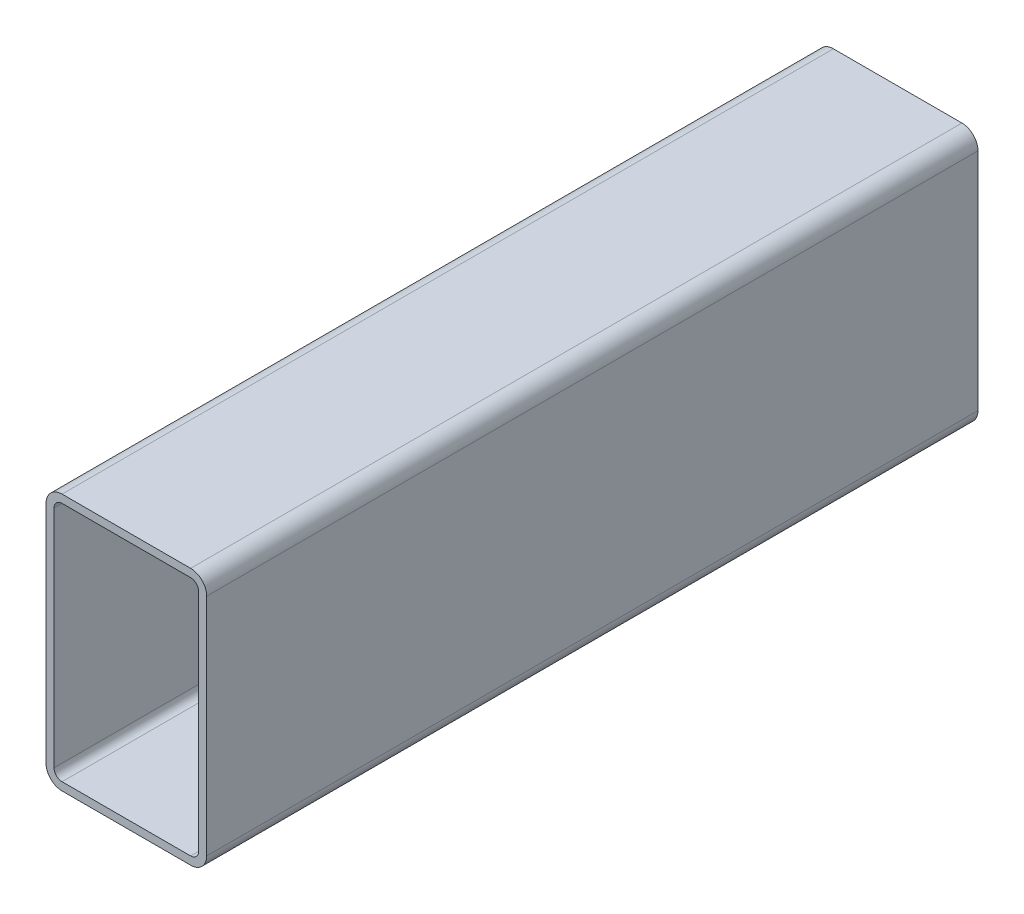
ISO-10303-21;
HEADER;
FILE_DESCRIPTION(('STEP AP214'),'2;1');
FILE_NAME('part.step','',(''),(''),'','','');
FILE_SCHEMA(('AUTOMOTIVE_DESIGN { 1 0 10303 214 1 1 1 1 }'));
ENDSEC;
DATA;
#1=APPLICATION_CONTEXT('core data for automotive mechanical design processes');
#2=APPLICATION_PROTOCOL_DEFINITION('international standard','automotive_design',2000,#1);
#3=PRODUCT_CONTEXT('',#1,'mechanical');
#4=PRODUCT('Part','Part','',(#3));
#5=PRODUCT_RELATED_PRODUCT_CATEGORY('part','',(#4));
#6=PRODUCT_DEFINITION_FORMATION('','',#4);
#7=PRODUCT_DEFINITION_CONTEXT('part definition',#1,'design');
#8=PRODUCT_DEFINITION('design','',#6,#7);
#9=PRODUCT_DEFINITION_SHAPE('','',#8);
#10=(LENGTH_UNIT() NAMED_UNIT(*) SI_UNIT(.MILLI.,.METRE.));
#11=(NAMED_UNIT(*) PLANE_ANGLE_UNIT() SI_UNIT($,.RADIAN.));
#12=(NAMED_UNIT(*) SI_UNIT($,.STERADIAN.) SOLID_ANGLE_UNIT());
#13=UNCERTAINTY_MEASURE_WITH_UNIT(LENGTH_MEASURE(1.E-05),#10,'distance_accuracy_value','');
#14=(GEOMETRIC_REPRESENTATION_CONTEXT(3) GLOBAL_UNCERTAINTY_ASSIGNED_CONTEXT((#13)) GLOBAL_UNIT_ASSIGNED_CONTEXT((#10,
#11,#12)) REPRESENTATION_CONTEXT('',''));
#15=CARTESIAN_POINT('',(0.,0.,0.));
#16=DIRECTION('',(0.,0.,1.));
#17=DIRECTION('',(1.,0.,0.));
#18=AXIS2_PLACEMENT_3D('',#15,#16,#17);
#19=CARTESIAN_POINT('',(9.24608514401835,97.3077651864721,304.8));
#20=DIRECTION('',(0.,0.,1.));
#21=DIRECTION('',(1.,0.,0.));
#22=AXIS2_PLACEMENT_3D('',#19,#20,#21);
#23=PLANE('',#22);
#24=CARTESIAN_POINT('',(9.24608514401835,97.3077651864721,304.8));
#25=DIRECTION('',(0.,0.,1.));
#26=DIRECTION('',(1.,0.,0.));
#27=AXIS2_PLACEMENT_3D('',#24,#25,#26);
#28=CIRCLE('',#27,6.35000000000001);
#29=CARTESIAN_POINT('',(9.24608514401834,103.657765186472,304.8));
#30=VERTEX_POINT('',#29);
#31=CARTESIAN_POINT('',(2.89608514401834,97.3077651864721,304.8));
#32=VERTEX_POINT('',#31);
#33=EDGE_CURVE('E211',#30,#32,#28,.T.);
#34=ORIENTED_EDGE('',*,*,#33,.T.);
#35=DIRECTION('',(0.,-1.,0.));
#36=VECTOR('',#35,1.);
#37=CARTESIAN_POINT('',(2.89608514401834,8.40776518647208,304.8));
#38=LINE('',#37,#36);
#39=CARTESIAN_POINT('',(2.89608514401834,8.40776518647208,304.8));
#40=VERTEX_POINT('',#39);
#41=EDGE_CURVE('E214',#32,#40,#38,.T.);
#42=ORIENTED_EDGE('',*,*,#41,.T.);
#43=CARTESIAN_POINT('',(9.24608514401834,8.40776518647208,304.8));
#44=DIRECTION('',(0.,0.,1.));
#45=DIRECTION('',(1.,0.,0.));
#46=AXIS2_PLACEMENT_3D('',#43,#44,#45);
#47=CIRCLE('',#46,6.35);
#48=CARTESIAN_POINT('',(9.24608514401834,2.05776518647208,304.8));
#49=VERTEX_POINT('',#48);
#50=EDGE_CURVE('E217',#40,#49,#47,.T.);
#51=ORIENTED_EDGE('',*,*,#50,.T.);
#52=DIRECTION('',(1.,0.,0.));
#53=VECTOR('',#52,1.);
#54=CARTESIAN_POINT('',(60.0460851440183,2.05776518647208,304.8));
#55=LINE('',#54,#53);
#56=CARTESIAN_POINT('',(60.0460851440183,2.05776518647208,304.8));
#57=VERTEX_POINT('',#56);
#58=EDGE_CURVE('E219',#49,#57,#55,.T.);
#59=ORIENTED_EDGE('',*,*,#58,.T.);
#60=CARTESIAN_POINT('',(60.0460851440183,8.40776518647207,304.8));
#61=DIRECTION('',(0.,0.,1.));
#62=DIRECTION('',(1.,0.,0.));
#63=AXIS2_PLACEMENT_3D('',#60,#61,#62);
#64=CIRCLE('',#63,6.35);
#65=CARTESIAN_POINT('',(66.3960851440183,8.40776518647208,304.8));
#66=VERTEX_POINT('',#65);
#67=EDGE_CURVE('E221',#57,#66,#64,.T.);
#68=ORIENTED_EDGE('',*,*,#67,.T.);
#69=DIRECTION('',(0.,1.,0.));
#70=VECTOR('',#69,1.);
#71=CARTESIAN_POINT('',(66.3960851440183,97.3077651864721,304.8));
#72=LINE('',#71,#70);
#73=CARTESIAN_POINT('',(66.3960851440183,97.3077651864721,304.8));
#74=VERTEX_POINT('',#73);
#75=EDGE_CURVE('E223',#66,#74,#72,.T.);
#76=ORIENTED_EDGE('',*,*,#75,.T.);
#77=CARTESIAN_POINT('',(60.0460851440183,97.3077651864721,304.8));
#78=DIRECTION('',(0.,0.,1.));
#79=DIRECTION('',(1.,0.,0.));
#80=AXIS2_PLACEMENT_3D('',#77,#78,#79);
#81=CIRCLE('',#80,6.35);
#82=CARTESIAN_POINT('',(60.0460851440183,103.657765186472,304.8));
#83=VERTEX_POINT('',#82);
#84=EDGE_CURVE('E225',#74,#83,#81,.T.);
#85=ORIENTED_EDGE('',*,*,#84,.T.);
#86=DIRECTION('',(-1.,0.,0.));
#87=VECTOR('',#86,1.);
#88=CARTESIAN_POINT('',(9.24608514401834,103.657765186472,304.8));
#89=LINE('',#88,#87);
#90=EDGE_CURVE('E227',#83,#30,#89,.T.);
#91=ORIENTED_EDGE('',*,*,#90,.T.);
#92=EDGE_LOOP('',(#34,#42,#51,#59,#68,#76,#85,#91));
#93=FACE_BOUND('',#92,.T.);
#94=DIRECTION('',(0.,-1.,0.));
#95=VECTOR('',#94,1.);
#96=CARTESIAN_POINT('',(6.07108514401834,8.40776518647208,304.8));
#97=LINE('',#96,#95);
#98=CARTESIAN_POINT('',(6.07108514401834,97.3077651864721,304.8));
#99=VERTEX_POINT('',#98);
#100=CARTESIAN_POINT('',(6.07108514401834,8.40776518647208,304.8));
#101=VERTEX_POINT('',#100);
#102=EDGE_CURVE('E154',#99,#101,#97,.T.);
#103=ORIENTED_EDGE('',*,*,#102,.F.);
#104=CARTESIAN_POINT('',(9.24608514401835,97.3077651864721,304.8));
#105=DIRECTION('',(0.,0.,1.));
#106=DIRECTION('',(1.,0.,0.));
#107=AXIS2_PLACEMENT_3D('',#104,#105,#106);
#108=CIRCLE('',#107,3.17500000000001);
#109=CARTESIAN_POINT('',(9.24608514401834,100.482765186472,304.8));
#110=VERTEX_POINT('',#109);
#111=EDGE_CURVE('E146',#110,#99,#108,.T.);
#112=ORIENTED_EDGE('',*,*,#111,.F.);
#113=DIRECTION('',(-1.,0.,0.));
#114=VECTOR('',#113,1.);
#115=CARTESIAN_POINT('',(9.24608514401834,100.482765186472,304.8));
#116=LINE('',#115,#114);
#117=CARTESIAN_POINT('',(60.0460851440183,100.482765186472,304.8));
#118=VERTEX_POINT('',#117);
#119=EDGE_CURVE('E179',#118,#110,#116,.T.);
#120=ORIENTED_EDGE('',*,*,#119,.F.);
#121=CARTESIAN_POINT('',(60.0460851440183,97.3077651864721,304.8));
#122=DIRECTION('',(0.,0.,1.));
#123=DIRECTION('',(1.,0.,0.));
#124=AXIS2_PLACEMENT_3D('',#121,#122,#123);
#125=CIRCLE('',#124,3.17500000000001);
#126=CARTESIAN_POINT('',(63.2210851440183,97.3077651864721,304.8));
#127=VERTEX_POINT('',#126);
#128=EDGE_CURVE('E177',#127,#118,#125,.T.);
#129=ORIENTED_EDGE('',*,*,#128,.F.);
#130=DIRECTION('',(0.,1.,0.));
#131=VECTOR('',#130,1.);
#132=CARTESIAN_POINT('',(63.2210851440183,97.3077651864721,304.8));
#133=LINE('',#132,#131);
#134=CARTESIAN_POINT('',(63.2210851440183,8.40776518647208,304.8));
#135=VERTEX_POINT('',#134);
#136=EDGE_CURVE('E175',#135,#127,#133,.T.);
#137=ORIENTED_EDGE('',*,*,#136,.F.);
#138=CARTESIAN_POINT('',(60.0460851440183,8.40776518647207,304.8));
#139=DIRECTION('',(0.,0.,1.));
#140=DIRECTION('',(1.,0.,0.));
#141=AXIS2_PLACEMENT_3D('',#138,#139,#140);
#142=CIRCLE('',#141,3.175);
#143=CARTESIAN_POINT('',(60.0460851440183,5.23276518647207,304.8));
#144=VERTEX_POINT('',#143);
#145=EDGE_CURVE('E173',#144,#135,#142,.T.);
#146=ORIENTED_EDGE('',*,*,#145,.F.);
#147=DIRECTION('',(1.,0.,0.));
#148=VECTOR('',#147,1.);
#149=CARTESIAN_POINT('',(60.0460851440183,5.23276518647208,304.8));
#150=LINE('',#149,#148);
#151=CARTESIAN_POINT('',(9.24608514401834,5.23276518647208,304.8));
#152=VERTEX_POINT('',#151);
#153=EDGE_CURVE('E169',#152,#144,#150,.T.);
#154=ORIENTED_EDGE('',*,*,#153,.F.);
#155=CARTESIAN_POINT('',(9.24608514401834,8.40776518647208,304.8));
#156=DIRECTION('',(0.,0.,1.));
#157=DIRECTION('',(1.,0.,0.));
#158=AXIS2_PLACEMENT_3D('',#155,#156,#157);
#159=CIRCLE('',#158,3.175);
#160=EDGE_CURVE('E167',#101,#152,#159,.T.);
#161=ORIENTED_EDGE('',*,*,#160,.F.);
#162=EDGE_LOOP('',(#103,#112,#120,#129,#137,#146,#154,#161));
#163=FACE_BOUND('',#162,.T.);
#164=ADVANCED_FACE('F33',(#93,#163),#23,.T.);
#165=CARTESIAN_POINT('',(9.24608514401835,97.3077651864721,0.));
#166=DIRECTION('',(0.,0.,1.));
#167=DIRECTION('',(1.,0.,0.));
#168=AXIS2_PLACEMENT_3D('',#165,#166,#167);
#169=PLANE('',#168);
#170=CARTESIAN_POINT('',(9.24608514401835,97.3077651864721,0.));
#171=DIRECTION('',(0.,0.,1.));
#172=DIRECTION('',(1.,0.,0.));
#173=AXIS2_PLACEMENT_3D('',#170,#171,#172);
#174=CIRCLE('',#173,6.35000000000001);
#175=CARTESIAN_POINT('',(9.24608514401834,103.657765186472,0.));
#176=VERTEX_POINT('',#175);
#177=CARTESIAN_POINT('',(2.89608514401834,97.3077651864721,0.));
#178=VERTEX_POINT('',#177);
#179=EDGE_CURVE('E162',#176,#178,#174,.T.);
#180=ORIENTED_EDGE('',*,*,#179,.F.);
#181=DIRECTION('',(-1.,0.,0.));
#182=VECTOR('',#181,1.);
#183=CARTESIAN_POINT('',(9.24608514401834,103.657765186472,0.));
#184=LINE('',#183,#182);
#185=CARTESIAN_POINT('',(60.0460851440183,103.657765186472,0.));
#186=VERTEX_POINT('',#185);
#187=EDGE_CURVE('E215',#186,#176,#184,.T.);
#188=ORIENTED_EDGE('',*,*,#187,.F.);
#189=CARTESIAN_POINT('',(60.0460851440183,97.3077651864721,0.));
#190=DIRECTION('',(0.,0.,1.));
#191=DIRECTION('',(1.,0.,0.));
#192=AXIS2_PLACEMENT_3D('',#189,#190,#191);
#193=CIRCLE('',#192,6.35);
#194=CARTESIAN_POINT('',(66.3960851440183,97.3077651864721,0.));
#195=VERTEX_POINT('',#194);
#196=EDGE_CURVE('E242',#195,#186,#193,.T.);
#197=ORIENTED_EDGE('',*,*,#196,.F.);
#198=DIRECTION('',(0.,1.,0.));
#199=VECTOR('',#198,1.);
#200=CARTESIAN_POINT('',(66.3960851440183,97.3077651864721,0.));
#201=LINE('',#200,#199);
#202=CARTESIAN_POINT('',(66.3960851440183,8.40776518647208,0.));
#203=VERTEX_POINT('',#202);
#204=EDGE_CURVE('E240',#203,#195,#201,.T.);
#205=ORIENTED_EDGE('',*,*,#204,.F.);
#206=CARTESIAN_POINT('',(60.0460851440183,8.40776518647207,0.));
#207=DIRECTION('',(0.,0.,1.));
#208=DIRECTION('',(1.,0.,0.));
#209=AXIS2_PLACEMENT_3D('',#206,#207,#208);
#210=CIRCLE('',#209,6.35);
#211=CARTESIAN_POINT('',(60.0460851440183,2.05776518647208,0.));
#212=VERTEX_POINT('',#211);
#213=EDGE_CURVE('E238',#212,#203,#210,.T.);
#214=ORIENTED_EDGE('',*,*,#213,.F.);
#215=DIRECTION('',(1.,0.,0.));
#216=VECTOR('',#215,1.);
#217=CARTESIAN_POINT('',(60.0460851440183,2.05776518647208,0.));
#218=LINE('',#217,#216);
#219=CARTESIAN_POINT('',(9.24608514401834,2.05776518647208,0.));
#220=VERTEX_POINT('',#219);
#221=EDGE_CURVE('E236',#220,#212,#218,.T.);
#222=ORIENTED_EDGE('',*,*,#221,.F.);
#223=CARTESIAN_POINT('',(9.24608514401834,8.40776518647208,0.));
#224=DIRECTION('',(0.,0.,1.));
#225=DIRECTION('',(1.,0.,0.));
#226=AXIS2_PLACEMENT_3D('',#223,#224,#225);
#227=CIRCLE('',#226,6.35);
#228=CARTESIAN_POINT('',(2.89608514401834,8.40776518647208,0.));
#229=VERTEX_POINT('',#228);
#230=EDGE_CURVE('E234',#229,#220,#227,.T.);
#231=ORIENTED_EDGE('',*,*,#230,.F.);
#232=DIRECTION('',(0.,-1.,0.));
#233=VECTOR('',#232,1.);
#234=CARTESIAN_POINT('',(2.89608514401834,8.40776518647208,0.));
#235=LINE('',#234,#233);
#236=EDGE_CURVE('E232',#178,#229,#235,.T.);
#237=ORIENTED_EDGE('',*,*,#236,.F.);
#238=EDGE_LOOP('',(#180,#188,#197,#205,#214,#222,#231,#237));
#239=FACE_BOUND('',#238,.T.);
#240=CARTESIAN_POINT('',(9.24608514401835,97.3077651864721,0.));
#241=DIRECTION('',(0.,0.,1.));
#242=DIRECTION('',(1.,0.,0.));
#243=AXIS2_PLACEMENT_3D('',#240,#241,#242);
#244=CIRCLE('',#243,3.17500000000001);
#245=CARTESIAN_POINT('',(9.24608514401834,100.482765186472,0.));
#246=VERTEX_POINT('',#245);
#247=CARTESIAN_POINT('',(6.07108514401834,97.3077651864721,0.));
#248=VERTEX_POINT('',#247);
#249=EDGE_CURVE('E56',#246,#248,#244,.T.);
#250=ORIENTED_EDGE('',*,*,#249,.T.);
#251=DIRECTION('',(0.,-1.,0.));
#252=VECTOR('',#251,1.);
#253=CARTESIAN_POINT('',(6.07108514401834,8.40776518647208,0.));
#254=LINE('',#253,#252);
#255=CARTESIAN_POINT('',(6.07108514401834,8.40776518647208,0.));
#256=VERTEX_POINT('',#255);
#257=EDGE_CURVE('E161',#248,#256,#254,.T.);
#258=ORIENTED_EDGE('',*,*,#257,.T.);
#259=CARTESIAN_POINT('',(9.24608514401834,8.40776518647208,0.));
#260=DIRECTION('',(0.,0.,1.));
#261=DIRECTION('',(1.,0.,0.));
#262=AXIS2_PLACEMENT_3D('',#259,#260,#261);
#263=CIRCLE('',#262,3.175);
#264=CARTESIAN_POINT('',(9.24608514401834,5.23276518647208,0.));
#265=VERTEX_POINT('',#264);
#266=EDGE_CURVE('E183',#256,#265,#263,.T.);
#267=ORIENTED_EDGE('',*,*,#266,.T.);
#268=DIRECTION('',(1.,0.,0.));
#269=VECTOR('',#268,1.);
#270=CARTESIAN_POINT('',(60.0460851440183,5.23276518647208,0.));
#271=LINE('',#270,#269);
#272=CARTESIAN_POINT('',(60.0460851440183,5.23276518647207,0.));
#273=VERTEX_POINT('',#272);
#274=EDGE_CURVE('E186',#265,#273,#271,.T.);
#275=ORIENTED_EDGE('',*,*,#274,.T.);
#276=CARTESIAN_POINT('',(60.0460851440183,8.40776518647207,0.));
#277=DIRECTION('',(0.,0.,1.));
#278=DIRECTION('',(1.,0.,0.));
#279=AXIS2_PLACEMENT_3D('',#276,#277,#278);
#280=CIRCLE('',#279,3.175);
#281=CARTESIAN_POINT('',(63.2210851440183,8.40776518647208,0.));
#282=VERTEX_POINT('',#281);
#283=EDGE_CURVE('E189',#273,#282,#280,.T.);
#284=ORIENTED_EDGE('',*,*,#283,.T.);
#285=DIRECTION('',(0.,1.,0.));
#286=VECTOR('',#285,1.);
#287=CARTESIAN_POINT('',(63.2210851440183,97.3077651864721,0.));
#288=LINE('',#287,#286);
#289=CARTESIAN_POINT('',(63.2210851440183,97.3077651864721,0.));
#290=VERTEX_POINT('',#289);
#291=EDGE_CURVE('E192',#282,#290,#288,.T.);
#292=ORIENTED_EDGE('',*,*,#291,.T.);
#293=CARTESIAN_POINT('',(60.0460851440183,97.3077651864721,0.));
#294=DIRECTION('',(0.,0.,1.));
#295=DIRECTION('',(1.,0.,0.));
#296=AXIS2_PLACEMENT_3D('',#293,#294,#295);
#297=CIRCLE('',#296,3.17500000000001);
#298=CARTESIAN_POINT('',(60.0460851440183,100.482765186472,0.));
#299=VERTEX_POINT('',#298);
#300=EDGE_CURVE('E195',#290,#299,#297,.T.);
#301=ORIENTED_EDGE('',*,*,#300,.T.);
#302=DIRECTION('',(-1.,0.,0.));
#303=VECTOR('',#302,1.);
#304=CARTESIAN_POINT('',(9.24608514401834,100.482765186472,0.));
#305=LINE('',#304,#303);
#306=EDGE_CURVE('E155',#299,#246,#305,.T.);
#307=ORIENTED_EDGE('',*,*,#306,.T.);
#308=EDGE_LOOP('',(#250,#258,#267,#275,#284,#292,#301,#307));
#309=FACE_BOUND('',#308,.T.);
#310=ADVANCED_FACE('F272',(#239,#309),#169,.F.);
#311=CARTESIAN_POINT('',(9.24608514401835,97.3077651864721,304.8));
#312=DIRECTION('',(0.,0.,-1.));
#313=DIRECTION('',(-1.,0.,0.));
#314=AXIS2_PLACEMENT_3D('',#311,#312,#313);
#315=CYLINDRICAL_SURFACE('',#314,6.35000000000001);
#316=ORIENTED_EDGE('',*,*,#179,.T.);
#317=DIRECTION('',(0.,0.,-1.));
#318=VECTOR('',#317,1.);
#319=CARTESIAN_POINT('',(2.89608514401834,97.3077651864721,304.8));
#320=LINE('',#319,#318);
#321=EDGE_CURVE('E11',#32,#178,#320,.T.);
#322=ORIENTED_EDGE('',*,*,#321,.F.);
#323=ORIENTED_EDGE('',*,*,#33,.F.);
#324=DIRECTION('',(0.,0.,-1.));
#325=VECTOR('',#324,1.);
#326=CARTESIAN_POINT('',(9.24608514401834,103.657765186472,304.8));
#327=LINE('',#326,#325);
#328=EDGE_CURVE('E229',#30,#176,#327,.T.);
#329=ORIENTED_EDGE('',*,*,#328,.T.);
#330=EDGE_LOOP('',(#316,#322,#323,#329));
#331=FACE_BOUND('',#330,.T.);
#332=ADVANCED_FACE('F35',(#331),#315,.T.);
#333=CARTESIAN_POINT('',(2.89608514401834,8.40776518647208,304.8));
#334=DIRECTION('',(1.,0.,0.));
#335=DIRECTION('',(0.,0.,-1.));
#336=AXIS2_PLACEMENT_3D('',#333,#334,#335);
#337=PLANE('',#336);
#338=ORIENTED_EDGE('',*,*,#236,.T.);
#339=DIRECTION('',(0.,0.,-1.));
#340=VECTOR('',#339,1.);
#341=CARTESIAN_POINT('',(2.89608514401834,8.40776518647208,304.8));
#342=LINE('',#341,#340);
#343=EDGE_CURVE('E41',#40,#229,#342,.T.);
#344=ORIENTED_EDGE('',*,*,#343,.F.);
#345=ORIENTED_EDGE('',*,*,#41,.F.);
#346=ORIENTED_EDGE('',*,*,#321,.T.);
#347=EDGE_LOOP('',(#338,#344,#345,#346));
#348=FACE_BOUND('',#347,.T.);
#349=ADVANCED_FACE('F289',(#348),#337,.F.);
#350=CARTESIAN_POINT('',(9.24608514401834,8.40776518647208,304.8));
#351=DIRECTION('',(0.,0.,-1.));
#352=DIRECTION('',(-1.,0.,0.));
#353=AXIS2_PLACEMENT_3D('',#350,#351,#352);
#354=CYLINDRICAL_SURFACE('',#353,6.35);
#355=ORIENTED_EDGE('',*,*,#230,.T.);
#356=DIRECTION('',(0.,0.,-1.));
#357=VECTOR('',#356,1.);
#358=CARTESIAN_POINT('',(9.24608514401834,2.05776518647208,304.8));
#359=LINE('',#358,#357);
#360=EDGE_CURVE('E259',#49,#220,#359,.T.);
#361=ORIENTED_EDGE('',*,*,#360,.F.);
#362=ORIENTED_EDGE('',*,*,#50,.F.);
#363=ORIENTED_EDGE('',*,*,#343,.T.);
#364=EDGE_LOOP('',(#355,#361,#362,#363));
#365=FACE_BOUND('',#364,.T.);
#366=ADVANCED_FACE('F266',(#365),#354,.T.);
#367=CARTESIAN_POINT('',(60.0460851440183,2.05776518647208,304.8));
#368=DIRECTION('',(0.,1.,0.));
#369=DIRECTION('',(0.,0.,1.));
#370=AXIS2_PLACEMENT_3D('',#367,#368,#369);
#371=PLANE('',#370);
#372=ORIENTED_EDGE('',*,*,#221,.T.);
#373=DIRECTION('',(0.,0.,-1.));
#374=VECTOR('',#373,1.);
#375=CARTESIAN_POINT('',(60.0460851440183,2.05776518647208,304.8));
#376=LINE('',#375,#374);
#377=EDGE_CURVE('E256',#57,#212,#376,.T.);
#378=ORIENTED_EDGE('',*,*,#377,.F.);
#379=ORIENTED_EDGE('',*,*,#58,.F.);
#380=ORIENTED_EDGE('',*,*,#360,.T.);
#381=EDGE_LOOP('',(#372,#378,#379,#380));
#382=FACE_BOUND('',#381,.T.);
#383=ADVANCED_FACE('F278',(#382),#371,.F.);
#384=CARTESIAN_POINT('',(60.0460851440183,8.40776518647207,304.8));
#385=DIRECTION('',(0.,0.,-1.));
#386=DIRECTION('',(-1.,0.,0.));
#387=AXIS2_PLACEMENT_3D('',#384,#385,#386);
#388=CYLINDRICAL_SURFACE('',#387,6.35);
#389=ORIENTED_EDGE('',*,*,#213,.T.);
#390=DIRECTION('',(0.,0.,-1.));
#391=VECTOR('',#390,1.);
#392=CARTESIAN_POINT('',(66.3960851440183,8.40776518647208,304.8));
#393=LINE('',#392,#391);
#394=EDGE_CURVE('E253',#66,#203,#393,.T.);
#395=ORIENTED_EDGE('',*,*,#394,.F.);
#396=ORIENTED_EDGE('',*,*,#67,.F.);
#397=ORIENTED_EDGE('',*,*,#377,.T.);
#398=EDGE_LOOP('',(#389,#395,#396,#397));
#399=FACE_BOUND('',#398,.T.);
#400=ADVANCED_FACE('F282',(#399),#388,.T.);
#401=CARTESIAN_POINT('',(66.3960851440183,97.3077651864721,304.8));
#402=DIRECTION('',(-1.,0.,0.));
#403=DIRECTION('',(0.,0.,1.));
#404=AXIS2_PLACEMENT_3D('',#401,#402,#403);
#405=PLANE('',#404);
#406=ORIENTED_EDGE('',*,*,#204,.T.);
#407=DIRECTION('',(0.,0.,-1.));
#408=VECTOR('',#407,1.);
#409=CARTESIAN_POINT('',(66.3960851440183,97.3077651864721,304.8));
#410=LINE('',#409,#408);
#411=EDGE_CURVE('E250',#74,#195,#410,.T.);
#412=ORIENTED_EDGE('',*,*,#411,.F.);
#413=ORIENTED_EDGE('',*,*,#75,.F.);
#414=ORIENTED_EDGE('',*,*,#394,.T.);
#415=EDGE_LOOP('',(#406,#412,#413,#414));
#416=FACE_BOUND('',#415,.T.);
#417=ADVANCED_FACE('F302',(#416),#405,.F.);
#418=CARTESIAN_POINT('',(60.0460851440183,97.3077651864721,304.8));
#419=DIRECTION('',(0.,0.,-1.));
#420=DIRECTION('',(-1.,0.,0.));
#421=AXIS2_PLACEMENT_3D('',#418,#419,#420);
#422=CYLINDRICAL_SURFACE('',#421,6.35);
#423=ORIENTED_EDGE('',*,*,#196,.T.);
#424=DIRECTION('',(0.,0.,-1.));
#425=VECTOR('',#424,1.);
#426=CARTESIAN_POINT('',(60.0460851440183,103.657765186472,304.8));
#427=LINE('',#426,#425);
#428=EDGE_CURVE('E247',#83,#186,#427,.T.);
#429=ORIENTED_EDGE('',*,*,#428,.F.);
#430=ORIENTED_EDGE('',*,*,#84,.F.);
#431=ORIENTED_EDGE('',*,*,#411,.T.);
#432=EDGE_LOOP('',(#423,#429,#430,#431));
#433=FACE_BOUND('',#432,.T.);
#434=ADVANCED_FACE('F300',(#433),#422,.T.);
#435=CARTESIAN_POINT('',(9.24608514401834,103.657765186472,304.8));
#436=DIRECTION('',(0.,-1.,0.));
#437=DIRECTION('',(0.,0.,-1.));
#438=AXIS2_PLACEMENT_3D('',#435,#436,#437);
#439=PLANE('',#438);
#440=ORIENTED_EDGE('',*,*,#187,.T.);
#441=ORIENTED_EDGE('',*,*,#328,.F.);
#442=ORIENTED_EDGE('',*,*,#90,.F.);
#443=ORIENTED_EDGE('',*,*,#428,.T.);
#444=EDGE_LOOP('',(#440,#441,#442,#443));
#445=FACE_BOUND('',#444,.T.);
#446=ADVANCED_FACE('F295',(#445),#439,.F.);
#447=CARTESIAN_POINT('',(9.24608514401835,97.3077651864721,304.8));
#448=DIRECTION('',(0.,0.,-1.));
#449=DIRECTION('',(-1.,0.,0.));
#450=AXIS2_PLACEMENT_3D('',#447,#448,#449);
#451=CYLINDRICAL_SURFACE('',#450,3.17500000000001);
#452=ORIENTED_EDGE('',*,*,#249,.F.);
#453=DIRECTION('',(0.,0.,-1.));
#454=VECTOR('',#453,1.);
#455=CARTESIAN_POINT('',(9.24608514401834,100.482765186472,304.8));
#456=LINE('',#455,#454);
#457=EDGE_CURVE('E150',#110,#246,#456,.T.);
#458=ORIENTED_EDGE('',*,*,#457,.F.);
#459=ORIENTED_EDGE('',*,*,#111,.T.);
#460=DIRECTION('',(0.,0.,-1.));
#461=VECTOR('',#460,1.);
#462=CARTESIAN_POINT('',(6.07108514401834,97.3077651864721,304.8));
#463=LINE('',#462,#461);
#464=EDGE_CURVE('E149',#99,#248,#463,.T.);
#465=ORIENTED_EDGE('',*,*,#464,.T.);
#466=EDGE_LOOP('',(#452,#458,#459,#465));
#467=FACE_BOUND('',#466,.T.);
#468=ADVANCED_FACE('F148',(#467),#451,.F.);
#469=CARTESIAN_POINT('',(6.07108514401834,8.40776518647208,304.8));
#470=DIRECTION('',(1.,0.,0.));
#471=DIRECTION('',(0.,0.,-1.));
#472=AXIS2_PLACEMENT_3D('',#469,#470,#471);
#473=PLANE('',#472);
#474=ORIENTED_EDGE('',*,*,#257,.F.);
#475=ORIENTED_EDGE('',*,*,#464,.F.);
#476=ORIENTED_EDGE('',*,*,#102,.T.);
#477=DIRECTION('',(0.,0.,-1.));
#478=VECTOR('',#477,1.);
#479=CARTESIAN_POINT('',(6.07108514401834,8.40776518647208,304.8));
#480=LINE('',#479,#478);
#481=EDGE_CURVE('E163',#101,#256,#480,.T.);
#482=ORIENTED_EDGE('',*,*,#481,.T.);
#483=EDGE_LOOP('',(#474,#475,#476,#482));
#484=FACE_BOUND('',#483,.T.);
#485=ADVANCED_FACE('F158',(#484),#473,.T.);
#486=CARTESIAN_POINT('',(9.24608514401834,8.40776518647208,304.8));
#487=DIRECTION('',(0.,0.,-1.));
#488=DIRECTION('',(-1.,0.,0.));
#489=AXIS2_PLACEMENT_3D('',#486,#487,#488);
#490=CYLINDRICAL_SURFACE('',#489,3.175);
#491=ORIENTED_EDGE('',*,*,#266,.F.);
#492=ORIENTED_EDGE('',*,*,#481,.F.);
#493=ORIENTED_EDGE('',*,*,#160,.T.);
#494=DIRECTION('',(0.,0.,-1.));
#495=VECTOR('',#494,1.);
#496=CARTESIAN_POINT('',(9.24608514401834,5.23276518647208,304.8));
#497=LINE('',#496,#495);
#498=EDGE_CURVE('E208',#152,#265,#497,.T.);
#499=ORIENTED_EDGE('',*,*,#498,.T.);
#500=EDGE_LOOP('',(#491,#492,#493,#499));
#501=FACE_BOUND('',#500,.T.);
#502=ADVANCED_FACE('F327',(#501),#490,.F.);
#503=CARTESIAN_POINT('',(60.0460851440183,5.23276518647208,304.8));
#504=DIRECTION('',(0.,1.,0.));
#505=DIRECTION('',(0.,0.,1.));
#506=AXIS2_PLACEMENT_3D('',#503,#504,#505);
#507=PLANE('',#506);
#508=ORIENTED_EDGE('',*,*,#274,.F.);
#509=ORIENTED_EDGE('',*,*,#498,.F.);
#510=ORIENTED_EDGE('',*,*,#153,.T.);
#511=DIRECTION('',(0.,0.,-1.));
#512=VECTOR('',#511,1.);
#513=CARTESIAN_POINT('',(60.0460851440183,5.23276518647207,304.8));
#514=LINE('',#513,#512);
#515=EDGE_CURVE('E206',#144,#273,#514,.T.);
#516=ORIENTED_EDGE('',*,*,#515,.T.);
#517=EDGE_LOOP('',(#508,#509,#510,#516));
#518=FACE_BOUND('',#517,.T.);
#519=ADVANCED_FACE('F331',(#518),#507,.T.);
#520=CARTESIAN_POINT('',(60.0460851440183,8.40776518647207,304.8));
#521=DIRECTION('',(0.,0.,-1.));
#522=DIRECTION('',(-1.,0.,0.));
#523=AXIS2_PLACEMENT_3D('',#520,#521,#522);
#524=CYLINDRICAL_SURFACE('',#523,3.175);
#525=ORIENTED_EDGE('',*,*,#283,.F.);
#526=ORIENTED_EDGE('',*,*,#515,.F.);
#527=ORIENTED_EDGE('',*,*,#145,.T.);
#528=DIRECTION('',(0.,0.,-1.));
#529=VECTOR('',#528,1.);
#530=CARTESIAN_POINT('',(63.2210851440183,8.40776518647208,304.8));
#531=LINE('',#530,#529);
#532=EDGE_CURVE('E204',#135,#282,#531,.T.);
#533=ORIENTED_EDGE('',*,*,#532,.T.);
#534=EDGE_LOOP('',(#525,#526,#527,#533));
#535=FACE_BOUND('',#534,.T.);
#536=ADVANCED_FACE('F337',(#535),#524,.F.);
#537=CARTESIAN_POINT('',(63.2210851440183,97.3077651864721,304.8));
#538=DIRECTION('',(-1.,0.,0.));
#539=DIRECTION('',(0.,0.,1.));
#540=AXIS2_PLACEMENT_3D('',#537,#538,#539);
#541=PLANE('',#540);
#542=ORIENTED_EDGE('',*,*,#291,.F.);
#543=ORIENTED_EDGE('',*,*,#532,.F.);
#544=ORIENTED_EDGE('',*,*,#136,.T.);
#545=DIRECTION('',(0.,0.,-1.));
#546=VECTOR('',#545,1.);
#547=CARTESIAN_POINT('',(63.2210851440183,97.3077651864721,304.8));
#548=LINE('',#547,#546);
#549=EDGE_CURVE('E202',#127,#290,#548,.T.);
#550=ORIENTED_EDGE('',*,*,#549,.T.);
#551=EDGE_LOOP('',(#542,#543,#544,#550));
#552=FACE_BOUND('',#551,.T.);
#553=ADVANCED_FACE('F341',(#552),#541,.T.);
#554=CARTESIAN_POINT('',(60.0460851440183,97.3077651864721,304.8));
#555=DIRECTION('',(0.,0.,-1.));
#556=DIRECTION('',(-1.,0.,0.));
#557=AXIS2_PLACEMENT_3D('',#554,#555,#556);
#558=CYLINDRICAL_SURFACE('',#557,3.17500000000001);
#559=ORIENTED_EDGE('',*,*,#300,.F.);
#560=ORIENTED_EDGE('',*,*,#549,.F.);
#561=ORIENTED_EDGE('',*,*,#128,.T.);
#562=DIRECTION('',(0.,0.,-1.));
#563=VECTOR('',#562,1.);
#564=CARTESIAN_POINT('',(60.0460851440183,100.482765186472,304.8));
#565=LINE('',#564,#563);
#566=EDGE_CURVE('E48',#118,#299,#565,.T.);
#567=ORIENTED_EDGE('',*,*,#566,.T.);
#568=EDGE_LOOP('',(#559,#560,#561,#567));
#569=FACE_BOUND('',#568,.T.);
#570=ADVANCED_FACE('F345',(#569),#558,.F.);
#571=CARTESIAN_POINT('',(9.24608514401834,100.482765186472,304.8));
#572=DIRECTION('',(0.,-1.,0.));
#573=DIRECTION('',(0.,0.,-1.));
#574=AXIS2_PLACEMENT_3D('',#571,#572,#573);
#575=PLANE('',#574);
#576=ORIENTED_EDGE('',*,*,#306,.F.);
#577=ORIENTED_EDGE('',*,*,#566,.F.);
#578=ORIENTED_EDGE('',*,*,#119,.T.);
#579=ORIENTED_EDGE('',*,*,#457,.T.);
#580=EDGE_LOOP('',(#576,#577,#578,#579));
#581=FACE_BOUND('',#580,.T.);
#582=ADVANCED_FACE('F349',(#581),#575,.T.);
#583=CLOSED_SHELL('',(#164,#310,#332,#349,#366,#383,#400,#417,#434,#446,#468,#485,#502,#519,
#536,#553,#570,#582));
#584=MANIFOLD_SOLID_BREP('B2',#583);
#585=ADVANCED_BREP_SHAPE_REPRESENTATION('',(#18,#584),#14);
#586=SHAPE_DEFINITION_REPRESENTATION(#9,#585);
ENDSEC;
END-ISO-10303-21;
